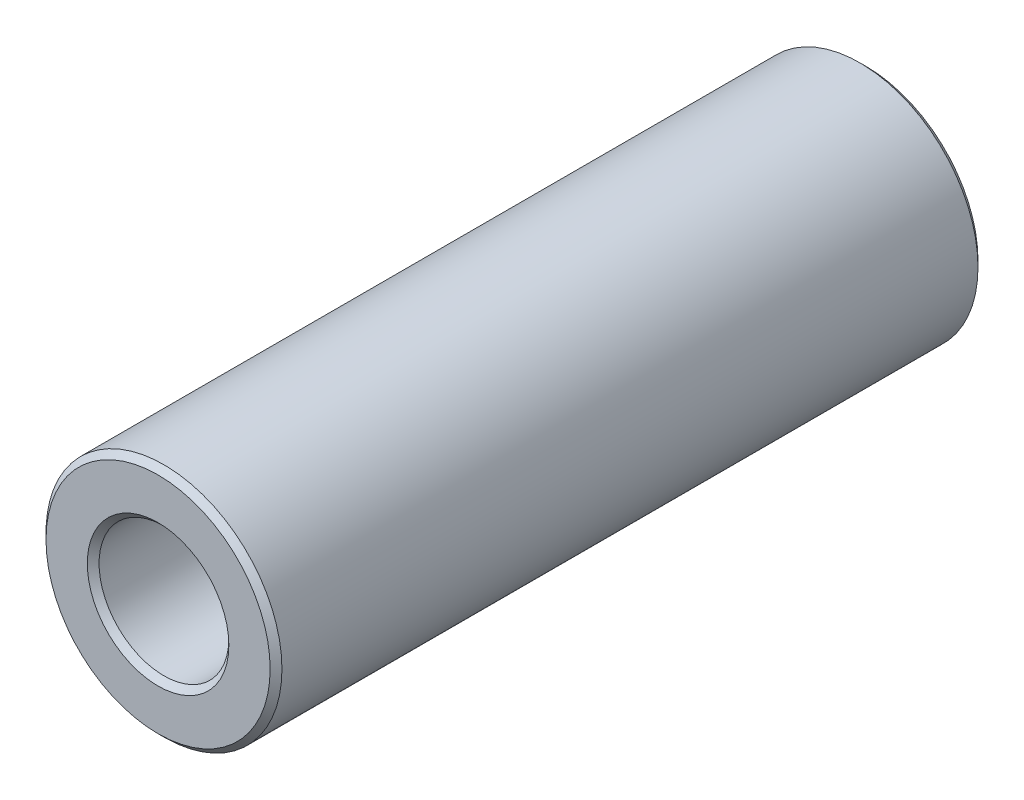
from build123d import *

# Parameters (mm, degrees)
SKETCH1_R           = 2
SKETCH1_R_2         = 1.1
BOSS_EXTRUDE2_DEPTH = 6
CHAMFER3_SIZE       = 0.1


with BuildPart() as part:
    # Sketch1 → Boss-Extrude2 (new, symmetric)
    with BuildSketch(Plane.XY):
        Circle(SKETCH1_R)
        Circle(SKETCH1_R_2, mode=Mode.SUBTRACT)
    extrude(amount=BOSS_EXTRUDE2_DEPTH, both=True)

    # Chamfer3
    chamfer3_edges = [part.edges().sort_by_distance(p)[0] for p in [
        (-2, 0, -6),
        (-2, 0, 6),
        (-1.1, 0, -6),
        (-1.1, 0, 6),
    ]]
    chamfer(chamfer3_edges, length=CHAMFER3_SIZE)


solid = part.part
